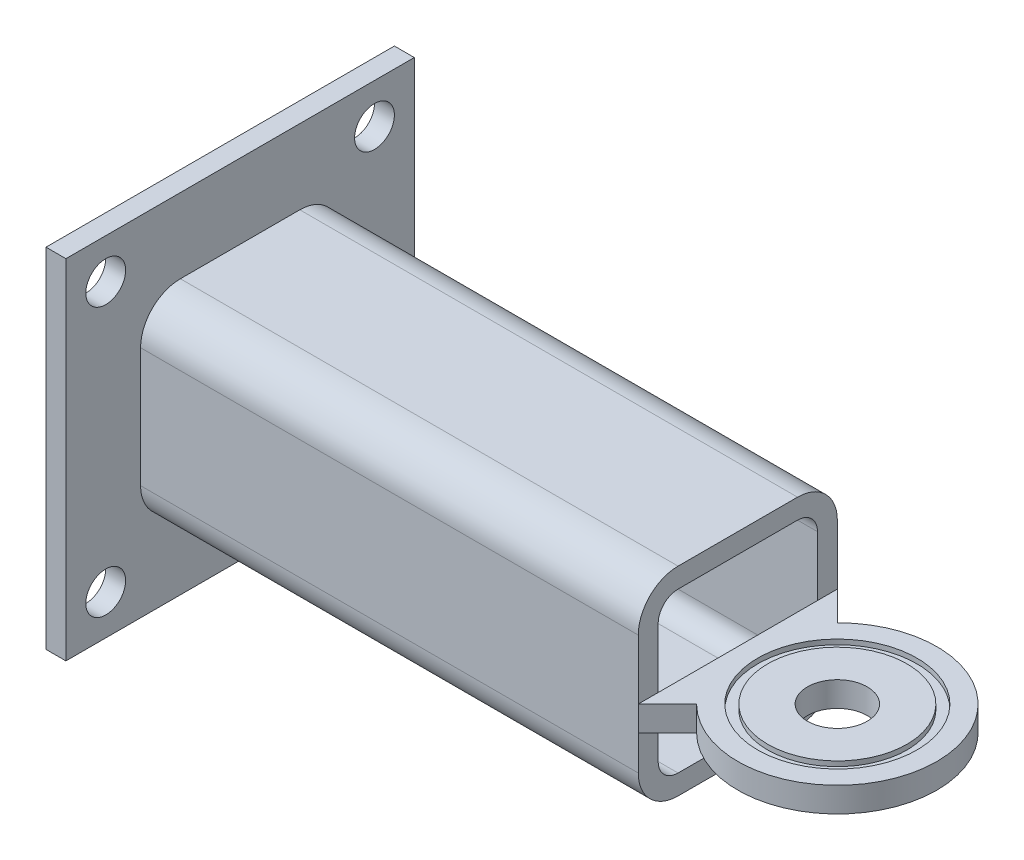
ISO-10303-21;
HEADER;
FILE_DESCRIPTION(('STEP AP214'),'2;1');
FILE_NAME('part.step','',(''),(''),'','','');
FILE_SCHEMA(('AUTOMOTIVE_DESIGN { 1 0 10303 214 1 1 1 1 }'));
ENDSEC;
DATA;
#1=APPLICATION_CONTEXT('core data for automotive mechanical design processes');
#2=APPLICATION_PROTOCOL_DEFINITION('international standard','automotive_design',2000,#1);
#3=PRODUCT_CONTEXT('',#1,'mechanical');
#4=PRODUCT('Part','Part','',(#3));
#5=PRODUCT_RELATED_PRODUCT_CATEGORY('part','',(#4));
#6=PRODUCT_DEFINITION_FORMATION('','',#4);
#7=PRODUCT_DEFINITION_CONTEXT('part definition',#1,'design');
#8=PRODUCT_DEFINITION('design','',#6,#7);
#9=PRODUCT_DEFINITION_SHAPE('','',#8);
#10=(LENGTH_UNIT() NAMED_UNIT(*) SI_UNIT(.MILLI.,.METRE.));
#11=(NAMED_UNIT(*) PLANE_ANGLE_UNIT() SI_UNIT($,.RADIAN.));
#12=(NAMED_UNIT(*) SI_UNIT($,.STERADIAN.) SOLID_ANGLE_UNIT());
#13=UNCERTAINTY_MEASURE_WITH_UNIT(LENGTH_MEASURE(1.E-05),#10,'distance_accuracy_value','');
#14=(GEOMETRIC_REPRESENTATION_CONTEXT(3) GLOBAL_UNCERTAINTY_ASSIGNED_CONTEXT((#13)) GLOBAL_UNIT_ASSIGNED_CONTEXT((#10,
#11,#12)) REPRESENTATION_CONTEXT('',''));
#15=CARTESIAN_POINT('',(0.,0.,0.));
#16=DIRECTION('',(0.,0.,1.));
#17=DIRECTION('',(1.,0.,0.));
#18=AXIS2_PLACEMENT_3D('',#15,#16,#17);
#19=CARTESIAN_POINT('',(42.6756198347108,-2.5,10.));
#20=DIRECTION('',(0.,1.,0.));
#21=DIRECTION('',(0.,0.,1.));
#22=AXIS2_PLACEMENT_3D('',#19,#20,#21);
#23=PLANE('',#22);
#24=CARTESIAN_POINT('',(32.6756198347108,-2.5,0.));
#25=DIRECTION('',(0.,1.,0.));
#26=DIRECTION('',(0.,0.,1.));
#27=AXIS2_PLACEMENT_3D('',#24,#25,#26);
#28=CIRCLE('',#27,3.);
#29=CARTESIAN_POINT('',(32.6756198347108,-2.5,3.));
#30=VERTEX_POINT('',#29);
#31=EDGE_CURVE('E77',#30,#30,#28,.T.);
#32=ORIENTED_EDGE('',*,*,#31,.T.);
#33=EDGE_LOOP('',(#32));
#34=FACE_BOUND('',#33,.T.);
#35=CARTESIAN_POINT('',(32.6756198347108,-2.5,0.));
#36=DIRECTION('',(0.,-1.,0.));
#37=DIRECTION('',(0.,0.,-1.));
#38=AXIS2_PLACEMENT_3D('',#35,#36,#37);
#39=CIRCLE('',#38,7.);
#40=CARTESIAN_POINT('',(32.6756198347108,-2.5,-7.));
#41=VERTEX_POINT('',#40);
#42=EDGE_CURVE('E281',#41,#41,#39,.T.);
#43=ORIENTED_EDGE('',*,*,#42,.T.);
#44=EDGE_LOOP('',(#43));
#45=FACE_BOUND('',#44,.T.);
#46=ADVANCED_FACE('F73',(#34,#45),#23,.F.);
#47=CARTESIAN_POINT('',(42.6756198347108,0.,10.));
#48=DIRECTION('',(0.,-1.,0.));
#49=DIRECTION('',(0.,0.,-1.));
#50=AXIS2_PLACEMENT_3D('',#47,#48,#49);
#51=PLANE('',#50);
#52=CARTESIAN_POINT('',(32.6756198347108,0.,0.));
#53=DIRECTION('',(0.,1.,0.));
#54=DIRECTION('',(0.,0.,1.));
#55=AXIS2_PLACEMENT_3D('',#52,#53,#54);
#56=CIRCLE('',#55,3.);
#57=CARTESIAN_POINT('',(32.6756198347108,0.,3.));
#58=VERTEX_POINT('',#57);
#59=EDGE_CURVE('E316',#58,#58,#56,.T.);
#60=ORIENTED_EDGE('',*,*,#59,.F.);
#61=EDGE_LOOP('',(#60));
#62=FACE_BOUND('',#61,.T.);
#63=CARTESIAN_POINT('',(32.6756198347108,0.,0.));
#64=DIRECTION('',(0.,1.,0.));
#65=DIRECTION('',(0.,0.,1.));
#66=AXIS2_PLACEMENT_3D('',#63,#64,#65);
#67=CIRCLE('',#66,7.);
#68=CARTESIAN_POINT('',(32.6756198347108,0.,7.));
#69=VERTEX_POINT('',#68);
#70=EDGE_CURVE('E300',#69,#69,#67,.T.);
#71=ORIENTED_EDGE('',*,*,#70,.T.);
#72=EDGE_LOOP('',(#71));
#73=FACE_BOUND('',#72,.T.);
#74=ADVANCED_FACE('F670',(#62,#73),#51,.F.);
#75=CARTESIAN_POINT('',(22.6756198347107,-6.,10.));
#76=DIRECTION('',(0.,0.,-1.));
#77=DIRECTION('',(-1.,0.,0.));
#78=AXIS2_PLACEMENT_3D('',#75,#76,#77);
#79=PLANE('',#78);
#80=DIRECTION('',(0.,-1.,0.));
#81=VECTOR('',#80,1.);
#82=CARTESIAN_POINT('',(22.6756198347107,-6.,10.));
#83=LINE('',#82,#81);
#84=CARTESIAN_POINT('',(22.6756198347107,-2.5,10.));
#85=VERTEX_POINT('',#84);
#86=CARTESIAN_POINT('',(22.6756198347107,-6.,10.));
#87=VERTEX_POINT('',#86);
#88=EDGE_CURVE('E412',#85,#87,#83,.T.);
#89=ORIENTED_EDGE('',*,*,#88,.F.);
#90=DIRECTION('',(0.,1.,0.));
#91=VECTOR('',#90,1.);
#92=CARTESIAN_POINT('',(22.6756198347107,-20.,10.));
#93=LINE('',#92,#91);
#94=CARTESIAN_POINT('',(22.6756198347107,0.,10.));
#95=VERTEX_POINT('',#94);
#96=EDGE_CURVE('E328',#85,#95,#93,.T.);
#97=ORIENTED_EDGE('',*,*,#96,.T.);
#98=CARTESIAN_POINT('',(22.6756198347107,6.,10.));
#99=VERTEX_POINT('',#98);
#100=EDGE_CURVE('E413',#99,#95,#83,.T.);
#101=ORIENTED_EDGE('',*,*,#100,.F.);
#102=DIRECTION('',(-1.,0.,0.));
#103=VECTOR('',#102,1.);
#104=CARTESIAN_POINT('',(22.6756198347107,6.,10.));
#105=LINE('',#104,#103);
#106=CARTESIAN_POINT('',(-27.3243801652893,6.,10.));
#107=VERTEX_POINT('',#106);
#108=EDGE_CURVE('E514',#99,#107,#105,.T.);
#109=ORIENTED_EDGE('',*,*,#108,.T.);
#110=DIRECTION('',(0.,-1.,0.));
#111=VECTOR('',#110,1.);
#112=CARTESIAN_POINT('',(-27.3243801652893,-6.,10.));
#113=LINE('',#112,#111);
#114=CARTESIAN_POINT('',(-27.3243801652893,-6.,10.));
#115=VERTEX_POINT('',#114);
#116=EDGE_CURVE('E474',#107,#115,#113,.T.);
#117=ORIENTED_EDGE('',*,*,#116,.T.);
#118=DIRECTION('',(-1.,0.,0.));
#119=VECTOR('',#118,1.);
#120=CARTESIAN_POINT('',(22.6756198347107,-6.,10.));
#121=LINE('',#120,#119);
#122=EDGE_CURVE('E510',#87,#115,#121,.T.);
#123=ORIENTED_EDGE('',*,*,#122,.F.);
#124=EDGE_LOOP('',(#89,#97,#101,#109,#117,#123));
#125=FACE_BOUND('',#124,.T.);
#126=ADVANCED_FACE('F609',(#125),#79,.F.);
#127=CARTESIAN_POINT('',(32.6756198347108,0.,0.));
#128=DIRECTION('',(0.,1.,0.));
#129=DIRECTION('',(0.,0.,1.));
#130=AXIS2_PLACEMENT_3D('',#127,#128,#129);
#131=CIRCLE('',#130,8.);
#132=CARTESIAN_POINT('',(32.6756198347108,0.,8.));
#133=VERTEX_POINT('',#132);
#134=EDGE_CURVE('E308',#133,#133,#131,.T.);
#135=ORIENTED_EDGE('',*,*,#134,.F.);
#136=EDGE_LOOP('',(#135));
#137=FACE_BOUND('',#136,.T.);
#138=DIRECTION('',(-0.707106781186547,0.,0.707106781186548));
#139=VECTOR('',#138,1.);
#140=CARTESIAN_POINT('',(25.6045520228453,0.,7.07106781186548));
#141=LINE('',#140,#139);
#142=CARTESIAN_POINT('',(25.6045520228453,0.,7.07106781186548));
#143=VERTEX_POINT('',#142);
#144=EDGE_CURVE('E323',#143,#95,#141,.T.);
#145=ORIENTED_EDGE('',*,*,#144,.F.);
#146=CARTESIAN_POINT('',(32.6756198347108,0.,0.));
#147=DIRECTION('',(0.,-1.,0.));
#148=DIRECTION('',(0.,0.,-1.));
#149=AXIS2_PLACEMENT_3D('',#146,#147,#148);
#150=CIRCLE('',#149,10.);
#151=CARTESIAN_POINT('',(25.6045520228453,0.,-7.07106781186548));
#152=VERTEX_POINT('',#151);
#153=EDGE_CURVE('E353',#152,#143,#150,.T.);
#154=ORIENTED_EDGE('',*,*,#153,.F.);
#155=DIRECTION('',(0.707106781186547,0.,0.707106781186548));
#156=VECTOR('',#155,1.);
#157=CARTESIAN_POINT('',(25.6045520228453,0.,-7.07106781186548));
#158=LINE('',#157,#156);
#159=CARTESIAN_POINT('',(22.6756198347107,0.,-10.));
#160=VERTEX_POINT('',#159);
#161=EDGE_CURVE('E327',#160,#152,#158,.T.);
#162=ORIENTED_EDGE('',*,*,#161,.F.);
#163=DIRECTION('',(0.,0.,1.));
#164=VECTOR('',#163,1.);
#165=CARTESIAN_POINT('',(22.6756198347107,0.,10.));
#166=LINE('',#165,#164);
#167=CARTESIAN_POINT('',(22.6756198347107,0.,-8.));
#168=VERTEX_POINT('',#167);
#169=EDGE_CURVE('E360',#160,#168,#166,.T.);
#170=ORIENTED_EDGE('',*,*,#169,.T.);
#171=CARTESIAN_POINT('',(22.6756198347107,0.,8.));
#172=VERTEX_POINT('',#171);
#173=EDGE_CURVE('E359',#168,#172,#166,.T.);
#174=ORIENTED_EDGE('',*,*,#173,.T.);
#175=EDGE_CURVE('E83',#172,#95,#166,.T.);
#176=ORIENTED_EDGE('',*,*,#175,.T.);
#177=EDGE_LOOP('',(#145,#154,#162,#170,#174,#176));
#178=FACE_BOUND('',#177,.T.);
#179=ADVANCED_FACE('F638',(#137,#178),#51,.F.);
#180=CARTESIAN_POINT('',(32.6756198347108,-2.5,0.));
#181=DIRECTION('',(0.,-1.,0.));
#182=DIRECTION('',(0.,0.,-1.));
#183=AXIS2_PLACEMENT_3D('',#180,#181,#182);
#184=CIRCLE('',#183,8.);
#185=CARTESIAN_POINT('',(32.6756198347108,-2.5,-8.));
#186=VERTEX_POINT('',#185);
#187=EDGE_CURVE('E294',#186,#186,#184,.T.);
#188=ORIENTED_EDGE('',*,*,#187,.F.);
#189=EDGE_LOOP('',(#188));
#190=FACE_BOUND('',#189,.T.);
#191=CARTESIAN_POINT('',(32.6756198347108,-2.5,0.));
#192=DIRECTION('',(0.,1.,0.));
#193=DIRECTION('',(0.,0.,1.));
#194=AXIS2_PLACEMENT_3D('',#191,#192,#193);
#195=CIRCLE('',#194,10.);
#196=CARTESIAN_POINT('',(25.6045520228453,-2.5,-7.07106781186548));
#197=VERTEX_POINT('',#196);
#198=CARTESIAN_POINT('',(25.6045520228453,-2.5,7.07106781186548));
#199=VERTEX_POINT('',#198);
#200=EDGE_CURVE('E356',#197,#199,#195,.F.);
#201=ORIENTED_EDGE('',*,*,#200,.T.);
#202=DIRECTION('',(-0.707106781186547,0.,0.707106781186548));
#203=VECTOR('',#202,1.);
#204=CARTESIAN_POINT('',(32.6756198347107,-2.5,0.));
#205=LINE('',#204,#203);
#206=EDGE_CURVE('E349',#199,#85,#205,.T.);
#207=ORIENTED_EDGE('',*,*,#206,.T.);
#208=DIRECTION('',(0.,0.,-1.));
#209=VECTOR('',#208,1.);
#210=CARTESIAN_POINT('',(22.6756198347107,-2.5,10.));
#211=LINE('',#210,#209);
#212=CARTESIAN_POINT('',(22.6756198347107,-2.5,8.));
#213=VERTEX_POINT('',#212);
#214=EDGE_CURVE('E85',#85,#213,#211,.T.);
#215=ORIENTED_EDGE('',*,*,#214,.T.);
#216=CARTESIAN_POINT('',(22.6756198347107,-2.5,-8.));
#217=VERTEX_POINT('',#216);
#218=EDGE_CURVE('E86',#213,#217,#211,.T.);
#219=ORIENTED_EDGE('',*,*,#218,.T.);
#220=CARTESIAN_POINT('',(22.6756198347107,-2.5,-10.));
#221=VERTEX_POINT('',#220);
#222=EDGE_CURVE('E12',#217,#221,#211,.T.);
#223=ORIENTED_EDGE('',*,*,#222,.T.);
#224=DIRECTION('',(0.707106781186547,0.,0.707106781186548));
#225=VECTOR('',#224,1.);
#226=CARTESIAN_POINT('',(42.6756198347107,-2.5,10.));
#227=LINE('',#226,#225);
#228=EDGE_CURVE('E332',#221,#197,#227,.T.);
#229=ORIENTED_EDGE('',*,*,#228,.T.);
#230=EDGE_LOOP('',(#201,#207,#215,#219,#223,#229));
#231=FACE_BOUND('',#230,.T.);
#232=ADVANCED_FACE('F617',(#190,#231),#23,.F.);
#233=CARTESIAN_POINT('',(22.6756198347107,6.,-6.));
#234=DIRECTION('',(1.,0.,0.));
#235=DIRECTION('',(0.,0.,-1.));
#236=AXIS2_PLACEMENT_3D('',#233,#234,#235);
#237=PLANE('',#236);
#238=ORIENTED_EDGE('',*,*,#214,.F.);
#239=ORIENTED_EDGE('',*,*,#88,.T.);
#240=CARTESIAN_POINT('',(22.6756198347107,-6.,6.));
#241=DIRECTION('',(1.,0.,0.));
#242=DIRECTION('',(0.,0.,-1.));
#243=AXIS2_PLACEMENT_3D('',#240,#241,#242);
#244=CIRCLE('',#243,4.);
#245=CARTESIAN_POINT('',(22.6756198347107,-10.,6.));
#246=VERTEX_POINT('',#245);
#247=EDGE_CURVE('E416',#87,#246,#244,.T.);
#248=ORIENTED_EDGE('',*,*,#247,.T.);
#249=DIRECTION('',(0.,0.,-1.));
#250=VECTOR('',#249,1.);
#251=CARTESIAN_POINT('',(22.6756198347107,-10.,6.));
#252=LINE('',#251,#250);
#253=CARTESIAN_POINT('',(22.6756198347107,-10.,-6.));
#254=VERTEX_POINT('',#253);
#255=EDGE_CURVE('E419',#246,#254,#252,.T.);
#256=ORIENTED_EDGE('',*,*,#255,.T.);
#257=CARTESIAN_POINT('',(22.6756198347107,-6.,-6.));
#258=DIRECTION('',(1.,0.,0.));
#259=DIRECTION('',(0.,0.,-1.));
#260=AXIS2_PLACEMENT_3D('',#257,#258,#259);
#261=CIRCLE('',#260,4.);
#262=CARTESIAN_POINT('',(22.6756198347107,-6.,-10.));
#263=VERTEX_POINT('',#262);
#264=EDGE_CURVE('E422',#254,#263,#261,.T.);
#265=ORIENTED_EDGE('',*,*,#264,.T.);
#266=DIRECTION('',(0.,1.,0.));
#267=VECTOR('',#266,1.);
#268=CARTESIAN_POINT('',(22.6756198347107,6.,-10.));
#269=LINE('',#268,#267);
#270=EDGE_CURVE('E426',#263,#221,#269,.T.);
#271=ORIENTED_EDGE('',*,*,#270,.T.);
#272=ORIENTED_EDGE('',*,*,#222,.F.);
#273=DIRECTION('',(0.,1.,0.));
#274=VECTOR('',#273,1.);
#275=CARTESIAN_POINT('',(22.6756198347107,6.,-8.));
#276=LINE('',#275,#274);
#277=CARTESIAN_POINT('',(22.6756198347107,-6.,-8.));
#278=VERTEX_POINT('',#277);
#279=EDGE_CURVE('E381',#278,#217,#276,.T.);
#280=ORIENTED_EDGE('',*,*,#279,.F.);
#281=CARTESIAN_POINT('',(22.6756198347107,-6.,-6.));
#282=DIRECTION('',(1.,0.,0.));
#283=DIRECTION('',(0.,0.,-1.));
#284=AXIS2_PLACEMENT_3D('',#281,#282,#283);
#285=CIRCLE('',#284,2.);
#286=CARTESIAN_POINT('',(22.6756198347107,-8.,-6.));
#287=VERTEX_POINT('',#286);
#288=EDGE_CURVE('E385',#287,#278,#285,.T.);
#289=ORIENTED_EDGE('',*,*,#288,.F.);
#290=DIRECTION('',(0.,0.,-1.));
#291=VECTOR('',#290,1.);
#292=CARTESIAN_POINT('',(22.6756198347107,-8.,6.));
#293=LINE('',#292,#291);
#294=CARTESIAN_POINT('',(22.6756198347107,-8.,6.));
#295=VERTEX_POINT('',#294);
#296=EDGE_CURVE('E390',#295,#287,#293,.T.);
#297=ORIENTED_EDGE('',*,*,#296,.F.);
#298=CARTESIAN_POINT('',(22.6756198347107,-6.,6.));
#299=DIRECTION('',(1.,0.,0.));
#300=DIRECTION('',(0.,0.,-1.));
#301=AXIS2_PLACEMENT_3D('',#298,#299,#300);
#302=CIRCLE('',#301,2.);
#303=CARTESIAN_POINT('',(22.6756198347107,-6.,8.));
#304=VERTEX_POINT('',#303);
#305=EDGE_CURVE('E394',#304,#295,#302,.T.);
#306=ORIENTED_EDGE('',*,*,#305,.F.);
#307=DIRECTION('',(0.,-1.,0.));
#308=VECTOR('',#307,1.);
#309=CARTESIAN_POINT('',(22.6756198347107,-6.,8.));
#310=LINE('',#309,#308);
#311=EDGE_CURVE('E93',#213,#304,#310,.T.);
#312=ORIENTED_EDGE('',*,*,#311,.F.);
#313=EDGE_LOOP('',(#238,#239,#248,#256,#265,#271,#272,#280,#289,#297,#306,#312));
#314=FACE_BOUND('',#313,.T.);
#315=ADVANCED_FACE('F619',(#314),#237,.T.);
#316=CARTESIAN_POINT('',(22.6756198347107,6.,-6.));
#317=DIRECTION('',(-1.,0.,0.));
#318=DIRECTION('',(0.,0.,1.));
#319=AXIS2_PLACEMENT_3D('',#316,#317,#318);
#320=CYLINDRICAL_SURFACE('',#319,4.);
#321=CARTESIAN_POINT('',(-27.3243801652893,6.,-6.));
#322=DIRECTION('',(1.,0.,0.));
#323=DIRECTION('',(0.,0.,-1.));
#324=AXIS2_PLACEMENT_3D('',#321,#322,#323);
#325=CIRCLE('',#324,4.);
#326=CARTESIAN_POINT('',(-27.3243801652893,6.,-10.));
#327=VERTEX_POINT('',#326);
#328=CARTESIAN_POINT('',(-27.3243801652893,10.,-6.));
#329=VERTEX_POINT('',#328);
#330=EDGE_CURVE('E462',#327,#329,#325,.T.);
#331=ORIENTED_EDGE('',*,*,#330,.T.);
#332=DIRECTION('',(-1.,0.,0.));
#333=VECTOR('',#332,1.);
#334=CARTESIAN_POINT('',(22.6756198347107,10.,-6.));
#335=LINE('',#334,#333);
#336=CARTESIAN_POINT('',(22.6756198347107,10.,-6.));
#337=VERTEX_POINT('',#336);
#338=EDGE_CURVE('E522',#337,#329,#335,.T.);
#339=ORIENTED_EDGE('',*,*,#338,.F.);
#340=CARTESIAN_POINT('',(22.6756198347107,6.,-6.));
#341=DIRECTION('',(1.,0.,0.));
#342=DIRECTION('',(0.,0.,-1.));
#343=AXIS2_PLACEMENT_3D('',#340,#341,#342);
#344=CIRCLE('',#343,4.);
#345=CARTESIAN_POINT('',(22.6756198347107,6.,-10.));
#346=VERTEX_POINT('',#345);
#347=EDGE_CURVE('E401',#346,#337,#344,.T.);
#348=ORIENTED_EDGE('',*,*,#347,.F.);
#349=DIRECTION('',(-1.,0.,0.));
#350=VECTOR('',#349,1.);
#351=CARTESIAN_POINT('',(22.6756198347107,6.,-10.));
#352=LINE('',#351,#350);
#353=EDGE_CURVE('E493',#346,#327,#352,.T.);
#354=ORIENTED_EDGE('',*,*,#353,.T.);
#355=EDGE_LOOP('',(#331,#339,#348,#354));
#356=FACE_BOUND('',#355,.T.);
#357=ADVANCED_FACE('F598',(#356),#320,.T.);
#358=CARTESIAN_POINT('',(22.6756198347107,10.,-6.));
#359=DIRECTION('',(0.,-1.,0.));
#360=DIRECTION('',(0.,0.,-1.));
#361=AXIS2_PLACEMENT_3D('',#358,#359,#360);
#362=PLANE('',#361);
#363=DIRECTION('',(0.,0.,1.));
#364=VECTOR('',#363,1.);
#365=CARTESIAN_POINT('',(-27.3243801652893,10.,-6.));
#366=LINE('',#365,#364);
#367=CARTESIAN_POINT('',(-27.3243801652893,10.,6.));
#368=VERTEX_POINT('',#367);
#369=EDGE_CURVE('E466',#329,#368,#366,.T.);
#370=ORIENTED_EDGE('',*,*,#369,.T.);
#371=DIRECTION('',(-1.,0.,0.));
#372=VECTOR('',#371,1.);
#373=CARTESIAN_POINT('',(22.6756198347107,10.,6.));
#374=LINE('',#373,#372);
#375=CARTESIAN_POINT('',(22.6756198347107,10.,6.));
#376=VERTEX_POINT('',#375);
#377=EDGE_CURVE('E518',#376,#368,#374,.T.);
#378=ORIENTED_EDGE('',*,*,#377,.F.);
#379=DIRECTION('',(0.,0.,1.));
#380=VECTOR('',#379,1.);
#381=CARTESIAN_POINT('',(22.6756198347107,10.,-6.));
#382=LINE('',#381,#380);
#383=EDGE_CURVE('E406',#337,#376,#382,.T.);
#384=ORIENTED_EDGE('',*,*,#383,.F.);
#385=ORIENTED_EDGE('',*,*,#338,.T.);
#386=EDGE_LOOP('',(#370,#378,#384,#385));
#387=FACE_BOUND('',#386,.T.);
#388=ADVANCED_FACE('F600',(#387),#362,.F.);
#389=CARTESIAN_POINT('',(22.6756198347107,6.,6.));
#390=DIRECTION('',(-1.,0.,0.));
#391=DIRECTION('',(0.,0.,1.));
#392=AXIS2_PLACEMENT_3D('',#389,#390,#391);
#393=CYLINDRICAL_SURFACE('',#392,4.);
#394=CARTESIAN_POINT('',(-27.3243801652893,6.,6.));
#395=DIRECTION('',(1.,0.,0.));
#396=DIRECTION('',(0.,0.,-1.));
#397=AXIS2_PLACEMENT_3D('',#394,#395,#396);
#398=CIRCLE('',#397,4.);
#399=EDGE_CURVE('E470',#368,#107,#398,.T.);
#400=ORIENTED_EDGE('',*,*,#399,.T.);
#401=ORIENTED_EDGE('',*,*,#108,.F.);
#402=CARTESIAN_POINT('',(22.6756198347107,6.,6.));
#403=DIRECTION('',(1.,0.,0.));
#404=DIRECTION('',(0.,0.,-1.));
#405=AXIS2_PLACEMENT_3D('',#402,#403,#404);
#406=CIRCLE('',#405,4.);
#407=EDGE_CURVE('E409',#376,#99,#406,.T.);
#408=ORIENTED_EDGE('',*,*,#407,.F.);
#409=ORIENTED_EDGE('',*,*,#377,.T.);
#410=EDGE_LOOP('',(#400,#401,#408,#409));
#411=FACE_BOUND('',#410,.T.);
#412=ADVANCED_FACE('F606',(#411),#393,.T.);
#413=CARTESIAN_POINT('',(22.6756198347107,-6.,6.));
#414=DIRECTION('',(-1.,0.,0.));
#415=DIRECTION('',(0.,0.,1.));
#416=AXIS2_PLACEMENT_3D('',#413,#414,#415);
#417=CYLINDRICAL_SURFACE('',#416,4.);
#418=CARTESIAN_POINT('',(-27.3243801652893,-6.,6.));
#419=DIRECTION('',(1.,0.,0.));
#420=DIRECTION('',(0.,0.,-1.));
#421=AXIS2_PLACEMENT_3D('',#418,#419,#420);
#422=CIRCLE('',#421,4.);
#423=CARTESIAN_POINT('',(-27.3243801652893,-10.,6.));
#424=VERTEX_POINT('',#423);
#425=EDGE_CURVE('E478',#115,#424,#422,.T.);
#426=ORIENTED_EDGE('',*,*,#425,.T.);
#427=DIRECTION('',(-1.,0.,0.));
#428=VECTOR('',#427,1.);
#429=CARTESIAN_POINT('',(22.6756198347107,-10.,6.));
#430=LINE('',#429,#428);
#431=EDGE_CURVE('E506',#246,#424,#430,.T.);
#432=ORIENTED_EDGE('',*,*,#431,.F.);
#433=ORIENTED_EDGE('',*,*,#247,.F.);
#434=ORIENTED_EDGE('',*,*,#122,.T.);
#435=EDGE_LOOP('',(#426,#432,#433,#434));
#436=FACE_BOUND('',#435,.T.);
#437=ADVANCED_FACE('F623',(#436),#417,.T.);
#438=CARTESIAN_POINT('',(22.6756198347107,-10.,6.));
#439=DIRECTION('',(0.,1.,0.));
#440=DIRECTION('',(0.,0.,1.));
#441=AXIS2_PLACEMENT_3D('',#438,#439,#440);
#442=PLANE('',#441);
#443=DIRECTION('',(0.,0.,-1.));
#444=VECTOR('',#443,1.);
#445=CARTESIAN_POINT('',(-27.3243801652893,-10.,6.));
#446=LINE('',#445,#444);
#447=CARTESIAN_POINT('',(-27.3243801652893,-10.,-6.));
#448=VERTEX_POINT('',#447);
#449=EDGE_CURVE('E482',#424,#448,#446,.T.);
#450=ORIENTED_EDGE('',*,*,#449,.T.);
#451=DIRECTION('',(-1.,0.,0.));
#452=VECTOR('',#451,1.);
#453=CARTESIAN_POINT('',(22.6756198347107,-10.,-6.));
#454=LINE('',#453,#452);
#455=EDGE_CURVE('E502',#254,#448,#454,.T.);
#456=ORIENTED_EDGE('',*,*,#455,.F.);
#457=ORIENTED_EDGE('',*,*,#255,.F.);
#458=ORIENTED_EDGE('',*,*,#431,.T.);
#459=EDGE_LOOP('',(#450,#456,#457,#458));
#460=FACE_BOUND('',#459,.T.);
#461=ADVANCED_FACE('F627',(#460),#442,.F.);
#462=CARTESIAN_POINT('',(22.6756198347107,-6.,-6.));
#463=DIRECTION('',(-1.,0.,0.));
#464=DIRECTION('',(0.,0.,1.));
#465=AXIS2_PLACEMENT_3D('',#462,#463,#464);
#466=CYLINDRICAL_SURFACE('',#465,4.);
#467=CARTESIAN_POINT('',(-27.3243801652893,-6.,-6.));
#468=DIRECTION('',(1.,0.,0.));
#469=DIRECTION('',(0.,0.,-1.));
#470=AXIS2_PLACEMENT_3D('',#467,#468,#469);
#471=CIRCLE('',#470,4.);
#472=CARTESIAN_POINT('',(-27.3243801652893,-6.,-10.));
#473=VERTEX_POINT('',#472);
#474=EDGE_CURVE('E486',#448,#473,#471,.T.);
#475=ORIENTED_EDGE('',*,*,#474,.T.);
#476=DIRECTION('',(-1.,0.,0.));
#477=VECTOR('',#476,1.);
#478=CARTESIAN_POINT('',(22.6756198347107,-6.,-10.));
#479=LINE('',#478,#477);
#480=EDGE_CURVE('E497',#263,#473,#479,.T.);
#481=ORIENTED_EDGE('',*,*,#480,.F.);
#482=ORIENTED_EDGE('',*,*,#264,.F.);
#483=ORIENTED_EDGE('',*,*,#455,.T.);
#484=EDGE_LOOP('',(#475,#481,#482,#483));
#485=FACE_BOUND('',#484,.T.);
#486=ADVANCED_FACE('F632',(#485),#466,.T.);
#487=CARTESIAN_POINT('',(22.6756198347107,6.,6.));
#488=DIRECTION('',(-1.,0.,0.));
#489=DIRECTION('',(0.,0.,1.));
#490=AXIS2_PLACEMENT_3D('',#487,#488,#489);
#491=CYLINDRICAL_SURFACE('',#490,2.);
#492=CARTESIAN_POINT('',(-27.3243801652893,6.,6.));
#493=DIRECTION('',(1.,0.,0.));
#494=DIRECTION('',(0.,0.,-1.));
#495=AXIS2_PLACEMENT_3D('',#492,#493,#494);
#496=CIRCLE('',#495,2.);
#497=CARTESIAN_POINT('',(-27.3243801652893,8.,6.));
#498=VERTEX_POINT('',#497);
#499=CARTESIAN_POINT('',(-27.3243801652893,6.,8.));
#500=VERTEX_POINT('',#499);
#501=EDGE_CURVE('E366',#498,#500,#496,.T.);
#502=ORIENTED_EDGE('',*,*,#501,.F.);
#503=DIRECTION('',(-1.,0.,0.));
#504=VECTOR('',#503,1.);
#505=CARTESIAN_POINT('',(22.6756198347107,8.,6.));
#506=LINE('',#505,#504);
#507=CARTESIAN_POINT('',(22.6756198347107,8.,6.));
#508=VERTEX_POINT('',#507);
#509=EDGE_CURVE('E498',#508,#498,#506,.T.);
#510=ORIENTED_EDGE('',*,*,#509,.F.);
#511=CARTESIAN_POINT('',(22.6756198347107,6.,6.));
#512=DIRECTION('',(1.,0.,0.));
#513=DIRECTION('',(0.,0.,-1.));
#514=AXIS2_PLACEMENT_3D('',#511,#512,#513);
#515=CIRCLE('',#514,2.);
#516=CARTESIAN_POINT('',(22.6756198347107,6.,8.));
#517=VERTEX_POINT('',#516);
#518=EDGE_CURVE('E367',#508,#517,#515,.T.);
#519=ORIENTED_EDGE('',*,*,#518,.T.);
#520=DIRECTION('',(-1.,0.,0.));
#521=VECTOR('',#520,1.);
#522=CARTESIAN_POINT('',(22.6756198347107,6.,8.));
#523=LINE('',#522,#521);
#524=EDGE_CURVE('E430',#517,#500,#523,.T.);
#525=ORIENTED_EDGE('',*,*,#524,.T.);
#526=EDGE_LOOP('',(#502,#510,#519,#525));
#527=FACE_BOUND('',#526,.T.);
#528=ADVANCED_FACE('F75',(#527),#491,.F.);
#529=CARTESIAN_POINT('',(22.6756198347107,8.,-6.));
#530=DIRECTION('',(0.,-1.,0.));
#531=DIRECTION('',(0.,0.,-1.));
#532=AXIS2_PLACEMENT_3D('',#529,#530,#531);
#533=PLANE('',#532);
#534=DIRECTION('',(0.,0.,1.));
#535=VECTOR('',#534,1.);
#536=CARTESIAN_POINT('',(-27.3243801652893,8.,-6.));
#537=LINE('',#536,#535);
#538=CARTESIAN_POINT('',(-27.3243801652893,8.,-6.));
#539=VERTEX_POINT('',#538);
#540=EDGE_CURVE('E434',#539,#498,#537,.T.);
#541=ORIENTED_EDGE('',*,*,#540,.F.);
#542=DIRECTION('',(-1.,0.,0.));
#543=VECTOR('',#542,1.);
#544=CARTESIAN_POINT('',(22.6756198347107,8.,-6.));
#545=LINE('',#544,#543);
#546=CARTESIAN_POINT('',(22.6756198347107,8.,-6.));
#547=VERTEX_POINT('',#546);
#548=EDGE_CURVE('E543',#547,#539,#545,.T.);
#549=ORIENTED_EDGE('',*,*,#548,.F.);
#550=DIRECTION('',(0.,0.,1.));
#551=VECTOR('',#550,1.);
#552=CARTESIAN_POINT('',(22.6756198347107,8.,-6.));
#553=LINE('',#552,#551);
#554=EDGE_CURVE('E371',#547,#508,#553,.T.);
#555=ORIENTED_EDGE('',*,*,#554,.T.);
#556=ORIENTED_EDGE('',*,*,#509,.T.);
#557=EDGE_LOOP('',(#541,#549,#555,#556));
#558=FACE_BOUND('',#557,.T.);
#559=ADVANCED_FACE('F549',(#558),#533,.T.);
#560=CARTESIAN_POINT('',(22.6756198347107,6.,-6.));
#561=DIRECTION('',(-1.,0.,0.));
#562=DIRECTION('',(0.,0.,1.));
#563=AXIS2_PLACEMENT_3D('',#560,#561,#562);
#564=CYLINDRICAL_SURFACE('',#563,2.);
#565=CARTESIAN_POINT('',(-27.3243801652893,6.,-6.));
#566=DIRECTION('',(1.,0.,0.));
#567=DIRECTION('',(0.,0.,-1.));
#568=AXIS2_PLACEMENT_3D('',#565,#566,#567);
#569=CIRCLE('',#568,2.);
#570=CARTESIAN_POINT('',(-27.3243801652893,6.,-8.));
#571=VERTEX_POINT('',#570);
#572=EDGE_CURVE('E438',#571,#539,#569,.T.);
#573=ORIENTED_EDGE('',*,*,#572,.F.);
#574=DIRECTION('',(-1.,0.,0.));
#575=VECTOR('',#574,1.);
#576=CARTESIAN_POINT('',(22.6756198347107,6.,-8.));
#577=LINE('',#576,#575);
#578=CARTESIAN_POINT('',(22.6756198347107,6.,-8.));
#579=VERTEX_POINT('',#578);
#580=EDGE_CURVE('E540',#579,#571,#577,.T.);
#581=ORIENTED_EDGE('',*,*,#580,.F.);
#582=CARTESIAN_POINT('',(22.6756198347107,6.,-6.));
#583=DIRECTION('',(1.,0.,0.));
#584=DIRECTION('',(0.,0.,-1.));
#585=AXIS2_PLACEMENT_3D('',#582,#583,#584);
#586=CIRCLE('',#585,2.);
#587=EDGE_CURVE('E376',#579,#547,#586,.T.);
#588=ORIENTED_EDGE('',*,*,#587,.T.);
#589=ORIENTED_EDGE('',*,*,#548,.T.);
#590=EDGE_LOOP('',(#573,#581,#588,#589));
#591=FACE_BOUND('',#590,.T.);
#592=ADVANCED_FACE('F559',(#591),#564,.F.);
#593=CARTESIAN_POINT('',(22.6756198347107,6.,-8.));
#594=DIRECTION('',(0.,0.,1.));
#595=DIRECTION('',(1.,0.,0.));
#596=AXIS2_PLACEMENT_3D('',#593,#594,#595);
#597=PLANE('',#596);
#598=DIRECTION('',(0.,1.,0.));
#599=VECTOR('',#598,1.);
#600=CARTESIAN_POINT('',(-27.3243801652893,6.,-8.));
#601=LINE('',#600,#599);
#602=CARTESIAN_POINT('',(-27.3243801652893,-6.,-8.));
#603=VERTEX_POINT('',#602);
#604=EDGE_CURVE('E442',#603,#571,#601,.T.);
#605=ORIENTED_EDGE('',*,*,#604,.F.);
#606=DIRECTION('',(-1.,0.,0.));
#607=VECTOR('',#606,1.);
#608=CARTESIAN_POINT('',(22.6756198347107,-6.,-8.));
#609=LINE('',#608,#607);
#610=EDGE_CURVE('E537',#278,#603,#609,.T.);
#611=ORIENTED_EDGE('',*,*,#610,.F.);
#612=ORIENTED_EDGE('',*,*,#279,.T.);
#613=EDGE_CURVE('E386',#217,#168,#276,.T.);
#614=ORIENTED_EDGE('',*,*,#613,.T.);
#615=EDGE_CURVE('E380',#168,#579,#276,.T.);
#616=ORIENTED_EDGE('',*,*,#615,.T.);
#617=ORIENTED_EDGE('',*,*,#580,.T.);
#618=EDGE_LOOP('',(#605,#611,#612,#614,#616,#617));
#619=FACE_BOUND('',#618,.T.);
#620=ADVANCED_FACE('F581',(#619),#597,.T.);
#621=CARTESIAN_POINT('',(22.6756198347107,-6.,-6.));
#622=DIRECTION('',(-1.,0.,0.));
#623=DIRECTION('',(0.,0.,1.));
#624=AXIS2_PLACEMENT_3D('',#621,#622,#623);
#625=CYLINDRICAL_SURFACE('',#624,2.);
#626=CARTESIAN_POINT('',(-27.3243801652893,-6.,-6.));
#627=DIRECTION('',(1.,0.,0.));
#628=DIRECTION('',(0.,0.,-1.));
#629=AXIS2_PLACEMENT_3D('',#626,#627,#628);
#630=CIRCLE('',#629,2.);
#631=CARTESIAN_POINT('',(-27.3243801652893,-8.,-6.));
#632=VERTEX_POINT('',#631);
#633=EDGE_CURVE('E446',#632,#603,#630,.T.);
#634=ORIENTED_EDGE('',*,*,#633,.F.);
#635=DIRECTION('',(-1.,0.,0.));
#636=VECTOR('',#635,1.);
#637=CARTESIAN_POINT('',(22.6756198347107,-8.,-6.));
#638=LINE('',#637,#636);
#639=EDGE_CURVE('E534',#287,#632,#638,.T.);
#640=ORIENTED_EDGE('',*,*,#639,.F.);
#641=ORIENTED_EDGE('',*,*,#288,.T.);
#642=ORIENTED_EDGE('',*,*,#610,.T.);
#643=EDGE_LOOP('',(#634,#640,#641,#642));
#644=FACE_BOUND('',#643,.T.);
#645=ADVANCED_FACE('F578',(#644),#625,.F.);
#646=CARTESIAN_POINT('',(22.6756198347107,-8.,6.));
#647=DIRECTION('',(0.,1.,0.));
#648=DIRECTION('',(0.,0.,1.));
#649=AXIS2_PLACEMENT_3D('',#646,#647,#648);
#650=PLANE('',#649);
#651=DIRECTION('',(0.,0.,-1.));
#652=VECTOR('',#651,1.);
#653=CARTESIAN_POINT('',(-27.3243801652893,-8.,6.));
#654=LINE('',#653,#652);
#655=CARTESIAN_POINT('',(-27.3243801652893,-8.,6.));
#656=VERTEX_POINT('',#655);
#657=EDGE_CURVE('E450',#656,#632,#654,.T.);
#658=ORIENTED_EDGE('',*,*,#657,.F.);
#659=DIRECTION('',(-1.,0.,0.));
#660=VECTOR('',#659,1.);
#661=CARTESIAN_POINT('',(22.6756198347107,-8.,6.));
#662=LINE('',#661,#660);
#663=EDGE_CURVE('E531',#295,#656,#662,.T.);
#664=ORIENTED_EDGE('',*,*,#663,.F.);
#665=ORIENTED_EDGE('',*,*,#296,.T.);
#666=ORIENTED_EDGE('',*,*,#639,.T.);
#667=EDGE_LOOP('',(#658,#664,#665,#666));
#668=FACE_BOUND('',#667,.T.);
#669=ADVANCED_FACE('F574',(#668),#650,.T.);
#670=CARTESIAN_POINT('',(22.6756198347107,-6.,6.));
#671=DIRECTION('',(-1.,0.,0.));
#672=DIRECTION('',(0.,0.,1.));
#673=AXIS2_PLACEMENT_3D('',#670,#671,#672);
#674=CYLINDRICAL_SURFACE('',#673,2.);
#675=CARTESIAN_POINT('',(-27.3243801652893,-6.,6.));
#676=DIRECTION('',(1.,0.,0.));
#677=DIRECTION('',(0.,0.,-1.));
#678=AXIS2_PLACEMENT_3D('',#675,#676,#677);
#679=CIRCLE('',#678,2.);
#680=CARTESIAN_POINT('',(-27.3243801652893,-6.,8.));
#681=VERTEX_POINT('',#680);
#682=EDGE_CURVE('E454',#681,#656,#679,.T.);
#683=ORIENTED_EDGE('',*,*,#682,.F.);
#684=DIRECTION('',(-1.,0.,0.));
#685=VECTOR('',#684,1.);
#686=CARTESIAN_POINT('',(22.6756198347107,-6.,8.));
#687=LINE('',#686,#685);
#688=EDGE_CURVE('E528',#304,#681,#687,.T.);
#689=ORIENTED_EDGE('',*,*,#688,.F.);
#690=ORIENTED_EDGE('',*,*,#305,.T.);
#691=ORIENTED_EDGE('',*,*,#663,.T.);
#692=EDGE_LOOP('',(#683,#689,#690,#691));
#693=FACE_BOUND('',#692,.T.);
#694=ADVANCED_FACE('F571',(#693),#674,.F.);
#695=CARTESIAN_POINT('',(22.6756198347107,-6.,8.));
#696=DIRECTION('',(0.,0.,-1.));
#697=DIRECTION('',(-1.,0.,0.));
#698=AXIS2_PLACEMENT_3D('',#695,#696,#697);
#699=PLANE('',#698);
#700=DIRECTION('',(0.,-1.,0.));
#701=VECTOR('',#700,1.);
#702=CARTESIAN_POINT('',(-27.3243801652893,-6.,8.));
#703=LINE('',#702,#701);
#704=EDGE_CURVE('E458',#500,#681,#703,.T.);
#705=ORIENTED_EDGE('',*,*,#704,.F.);
#706=ORIENTED_EDGE('',*,*,#524,.F.);
#707=EDGE_CURVE('E398',#517,#172,#310,.T.);
#708=ORIENTED_EDGE('',*,*,#707,.T.);
#709=EDGE_CURVE('E402',#172,#213,#310,.T.);
#710=ORIENTED_EDGE('',*,*,#709,.T.);
#711=ORIENTED_EDGE('',*,*,#311,.T.);
#712=ORIENTED_EDGE('',*,*,#688,.T.);
#713=EDGE_LOOP('',(#705,#706,#708,#710,#711,#712));
#714=FACE_BOUND('',#713,.T.);
#715=ADVANCED_FACE('F566',(#714),#699,.T.);
#716=CARTESIAN_POINT('',(22.6756198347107,6.,-10.));
#717=DIRECTION('',(0.,0.,1.));
#718=DIRECTION('',(1.,0.,0.));
#719=AXIS2_PLACEMENT_3D('',#716,#717,#718);
#720=PLANE('',#719);
#721=EDGE_CURVE('E425',#160,#346,#269,.T.);
#722=ORIENTED_EDGE('',*,*,#721,.F.);
#723=DIRECTION('',(0.,1.,0.));
#724=VECTOR('',#723,1.);
#725=CARTESIAN_POINT('',(22.6756198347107,-20.,-10.));
#726=LINE('',#725,#724);
#727=EDGE_CURVE('E336',#221,#160,#726,.T.);
#728=ORIENTED_EDGE('',*,*,#727,.F.);
#729=ORIENTED_EDGE('',*,*,#270,.F.);
#730=ORIENTED_EDGE('',*,*,#480,.T.);
#731=DIRECTION('',(0.,1.,0.));
#732=VECTOR('',#731,1.);
#733=CARTESIAN_POINT('',(-27.3243801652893,6.,-10.));
#734=LINE('',#733,#732);
#735=EDGE_CURVE('E372',#473,#327,#734,.T.);
#736=ORIENTED_EDGE('',*,*,#735,.T.);
#737=ORIENTED_EDGE('',*,*,#353,.F.);
#738=EDGE_LOOP('',(#722,#728,#729,#730,#736,#737));
#739=FACE_BOUND('',#738,.T.);
#740=ADVANCED_FACE('F596',(#739),#720,.F.);
#741=ORIENTED_EDGE('',*,*,#169,.F.);
#742=ORIENTED_EDGE('',*,*,#721,.T.);
#743=ORIENTED_EDGE('',*,*,#347,.T.);
#744=ORIENTED_EDGE('',*,*,#383,.T.);
#745=ORIENTED_EDGE('',*,*,#407,.T.);
#746=ORIENTED_EDGE('',*,*,#100,.T.);
#747=ORIENTED_EDGE('',*,*,#175,.F.);
#748=ORIENTED_EDGE('',*,*,#707,.F.);
#749=ORIENTED_EDGE('',*,*,#518,.F.);
#750=ORIENTED_EDGE('',*,*,#554,.F.);
#751=ORIENTED_EDGE('',*,*,#587,.F.);
#752=ORIENTED_EDGE('',*,*,#615,.F.);
#753=EDGE_LOOP('',(#741,#742,#743,#744,#745,#746,#747,#748,#749,#750,#751,#752));
#754=FACE_BOUND('',#753,.T.);
#755=ADVANCED_FACE('F562',(#754),#237,.T.);
#756=CARTESIAN_POINT('',(22.6756198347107,0.,0.));
#757=DIRECTION('',(1.,0.,0.));
#758=DIRECTION('',(0.,0.,-1.));
#759=AXIS2_PLACEMENT_3D('',#756,#757,#758);
#760=PLANE('',#759);
#761=ORIENTED_EDGE('',*,*,#613,.F.);
#762=ORIENTED_EDGE('',*,*,#218,.F.);
#763=ORIENTED_EDGE('',*,*,#709,.F.);
#764=ORIENTED_EDGE('',*,*,#173,.F.);
#765=EDGE_LOOP('',(#761,#762,#763,#764));
#766=FACE_BOUND('',#765,.T.);
#767=ADVANCED_FACE('F644',(#766),#760,.F.);
#768=CARTESIAN_POINT('',(32.6756198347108,-20.,0.));
#769=DIRECTION('',(0.,1.,0.));
#770=DIRECTION('',(0.,0.,1.));
#771=AXIS2_PLACEMENT_3D('',#768,#769,#770);
#772=CYLINDRICAL_SURFACE('',#771,10.);
#773=ORIENTED_EDGE('',*,*,#200,.F.);
#774=DIRECTION('',(0.,1.,0.));
#775=VECTOR('',#774,1.);
#776=CARTESIAN_POINT('',(25.6045520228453,-20.,-7.07106781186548));
#777=LINE('',#776,#775);
#778=EDGE_CURVE('E339',#197,#152,#777,.T.);
#779=ORIENTED_EDGE('',*,*,#778,.T.);
#780=ORIENTED_EDGE('',*,*,#153,.T.);
#781=DIRECTION('',(0.,1.,0.));
#782=VECTOR('',#781,1.);
#783=CARTESIAN_POINT('',(25.6045520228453,-20.,7.07106781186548));
#784=LINE('',#783,#782);
#785=EDGE_CURVE('E326',#199,#143,#784,.T.);
#786=ORIENTED_EDGE('',*,*,#785,.F.);
#787=EDGE_LOOP('',(#773,#779,#780,#786));
#788=FACE_BOUND('',#787,.T.);
#789=ADVANCED_FACE('F641',(#788),#772,.T.);
#790=CARTESIAN_POINT('',(25.6045520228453,-20.,-7.07106781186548));
#791=DIRECTION('',(-0.707106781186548,0.,0.707106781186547));
#792=DIRECTION('',(0.707106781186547,0.,0.707106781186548));
#793=AXIS2_PLACEMENT_3D('',#790,#791,#792);
#794=PLANE('',#793);
#795=ORIENTED_EDGE('',*,*,#727,.T.);
#796=ORIENTED_EDGE('',*,*,#161,.T.);
#797=ORIENTED_EDGE('',*,*,#778,.F.);
#798=ORIENTED_EDGE('',*,*,#228,.F.);
#799=EDGE_LOOP('',(#795,#796,#797,#798));
#800=FACE_BOUND('',#799,.T.);
#801=ADVANCED_FACE('F635',(#800),#794,.F.);
#802=CARTESIAN_POINT('',(25.6045520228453,-20.,7.07106781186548));
#803=DIRECTION('',(-0.707106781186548,0.,-0.707106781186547));
#804=DIRECTION('',(-0.707106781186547,0.,0.707106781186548));
#805=AXIS2_PLACEMENT_3D('',#802,#803,#804);
#806=PLANE('',#805);
#807=ORIENTED_EDGE('',*,*,#785,.T.);
#808=ORIENTED_EDGE('',*,*,#144,.T.);
#809=ORIENTED_EDGE('',*,*,#96,.F.);
#810=ORIENTED_EDGE('',*,*,#206,.F.);
#811=EDGE_LOOP('',(#807,#808,#809,#810));
#812=FACE_BOUND('',#811,.T.);
#813=ADVANCED_FACE('F613',(#812),#806,.F.);
#814=CARTESIAN_POINT('',(32.6756198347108,-20.,0.));
#815=DIRECTION('',(0.,1.,0.));
#816=DIRECTION('',(0.,0.,1.));
#817=AXIS2_PLACEMENT_3D('',#814,#815,#816);
#818=CYLINDRICAL_SURFACE('',#817,3.);
#819=ORIENTED_EDGE('',*,*,#59,.T.);
#820=EDGE_LOOP('',(#819));
#821=FACE_BOUND('',#820,.T.);
#822=ORIENTED_EDGE('',*,*,#31,.F.);
#823=EDGE_LOOP('',(#822));
#824=FACE_BOUND('',#823,.T.);
#825=ADVANCED_FACE('F655',(#821,#824),#818,.F.);
#826=CARTESIAN_POINT('',(32.6756198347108,-0.5,0.));
#827=DIRECTION('',(0.,1.,0.));
#828=DIRECTION('',(0.,0.,1.));
#829=AXIS2_PLACEMENT_3D('',#826,#827,#828);
#830=CYLINDRICAL_SURFACE('',#829,8.);
#831=CARTESIAN_POINT('',(32.6756198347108,-0.5,0.));
#832=DIRECTION('',(0.,1.,0.));
#833=DIRECTION('',(0.,0.,1.));
#834=AXIS2_PLACEMENT_3D('',#831,#832,#833);
#835=CIRCLE('',#834,8.);
#836=CARTESIAN_POINT('',(32.6756198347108,-0.5,8.));
#837=VERTEX_POINT('',#836);
#838=EDGE_CURVE('E312',#837,#837,#835,.T.);
#839=ORIENTED_EDGE('',*,*,#838,.F.);
#840=EDGE_LOOP('',(#839));
#841=FACE_BOUND('',#840,.T.);
#842=ORIENTED_EDGE('',*,*,#134,.T.);
#843=EDGE_LOOP('',(#842));
#844=FACE_BOUND('',#843,.T.);
#845=ADVANCED_FACE('F657',(#841,#844),#830,.F.);
#846=CARTESIAN_POINT('',(32.6756198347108,-0.5,0.));
#847=DIRECTION('',(0.,1.,0.));
#848=DIRECTION('',(0.,0.,1.));
#849=AXIS2_PLACEMENT_3D('',#846,#847,#848);
#850=PLANE('',#849);
#851=CARTESIAN_POINT('',(32.6756198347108,-0.5,0.));
#852=DIRECTION('',(0.,1.,0.));
#853=DIRECTION('',(0.,0.,1.));
#854=AXIS2_PLACEMENT_3D('',#851,#852,#853);
#855=CIRCLE('',#854,7.);
#856=CARTESIAN_POINT('',(32.6756198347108,-0.5,7.));
#857=VERTEX_POINT('',#856);
#858=EDGE_CURVE('E304',#857,#857,#855,.T.);
#859=ORIENTED_EDGE('',*,*,#858,.F.);
#860=EDGE_LOOP('',(#859));
#861=FACE_BOUND('',#860,.T.);
#862=ORIENTED_EDGE('',*,*,#838,.T.);
#863=EDGE_LOOP('',(#862));
#864=FACE_BOUND('',#863,.T.);
#865=ADVANCED_FACE('F665',(#861,#864),#850,.T.);
#866=CARTESIAN_POINT('',(32.6756198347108,-0.5,0.));
#867=DIRECTION('',(0.,1.,0.));
#868=DIRECTION('',(0.,0.,1.));
#869=AXIS2_PLACEMENT_3D('',#866,#867,#868);
#870=CYLINDRICAL_SURFACE('',#869,7.);
#871=ORIENTED_EDGE('',*,*,#858,.T.);
#872=EDGE_LOOP('',(#871));
#873=FACE_BOUND('',#872,.T.);
#874=ORIENTED_EDGE('',*,*,#70,.F.);
#875=EDGE_LOOP('',(#874));
#876=FACE_BOUND('',#875,.T.);
#877=ADVANCED_FACE('F691',(#873,#876),#870,.T.);
#878=CARTESIAN_POINT('',(32.6756198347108,-2.3,0.));
#879=DIRECTION('',(0.,-1.,0.));
#880=DIRECTION('',(0.,0.,-1.));
#881=AXIS2_PLACEMENT_3D('',#878,#879,#880);
#882=CYLINDRICAL_SURFACE('',#881,8.);
#883=CARTESIAN_POINT('',(32.6756198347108,-2.3,0.));
#884=DIRECTION('',(0.,-1.,0.));
#885=DIRECTION('',(0.,0.,-1.));
#886=AXIS2_PLACEMENT_3D('',#883,#884,#885);
#887=CIRCLE('',#886,8.);
#888=CARTESIAN_POINT('',(32.6756198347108,-2.3,-8.));
#889=VERTEX_POINT('',#888);
#890=EDGE_CURVE('E296',#889,#889,#887,.T.);
#891=ORIENTED_EDGE('',*,*,#890,.F.);
#892=EDGE_LOOP('',(#891));
#893=FACE_BOUND('',#892,.T.);
#894=ORIENTED_EDGE('',*,*,#187,.T.);
#895=EDGE_LOOP('',(#894));
#896=FACE_BOUND('',#895,.T.);
#897=ADVANCED_FACE('F689',(#893,#896),#882,.F.);
#898=CARTESIAN_POINT('',(32.6756198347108,-2.3,0.));
#899=DIRECTION('',(0.,-1.,0.));
#900=DIRECTION('',(0.,0.,-1.));
#901=AXIS2_PLACEMENT_3D('',#898,#899,#900);
#902=PLANE('',#901);
#903=CARTESIAN_POINT('',(32.6756198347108,-2.3,0.));
#904=DIRECTION('',(0.,-1.,0.));
#905=DIRECTION('',(0.,0.,-1.));
#906=AXIS2_PLACEMENT_3D('',#903,#904,#905);
#907=CIRCLE('',#906,7.);
#908=CARTESIAN_POINT('',(32.6756198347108,-2.3,-7.));
#909=VERTEX_POINT('',#908);
#910=EDGE_CURVE('E286',#909,#909,#907,.T.);
#911=ORIENTED_EDGE('',*,*,#910,.F.);
#912=EDGE_LOOP('',(#911));
#913=FACE_BOUND('',#912,.T.);
#914=ORIENTED_EDGE('',*,*,#890,.T.);
#915=EDGE_LOOP('',(#914));
#916=FACE_BOUND('',#915,.T.);
#917=ADVANCED_FACE('F690',(#913,#916),#902,.T.);
#918=CARTESIAN_POINT('',(32.6756198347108,-2.3,0.));
#919=DIRECTION('',(0.,-1.,0.));
#920=DIRECTION('',(0.,0.,-1.));
#921=AXIS2_PLACEMENT_3D('',#918,#919,#920);
#922=CYLINDRICAL_SURFACE('',#921,7.);
#923=ORIENTED_EDGE('',*,*,#910,.T.);
#924=EDGE_LOOP('',(#923));
#925=FACE_BOUND('',#924,.T.);
#926=ORIENTED_EDGE('',*,*,#42,.F.);
#927=EDGE_LOOP('',(#926));
#928=FACE_BOUND('',#927,.T.);
#929=ADVANCED_FACE('F697',(#925,#928),#922,.T.);
#930=CARTESIAN_POINT('',(-27.3243801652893,0.,0.));
#931=DIRECTION('',(-1.,0.,0.));
#932=DIRECTION('',(0.,0.,1.));
#933=AXIS2_PLACEMENT_3D('',#930,#931,#932);
#934=PLANE('',#933);
#935=CARTESIAN_POINT('',(-27.3243801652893,13.5,-13.5));
#936=DIRECTION('',(1.,0.,0.));
#937=DIRECTION('',(0.,0.,-1.));
#938=AXIS2_PLACEMENT_3D('',#935,#936,#937);
#939=CIRCLE('',#938,2.);
#940=CARTESIAN_POINT('',(-27.3243801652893,13.5,-15.5));
#941=VERTEX_POINT('',#940);
#942=EDGE_CURVE('E860',#941,#941,#939,.T.);
#943=ORIENTED_EDGE('',*,*,#942,.F.);
#944=EDGE_LOOP('',(#943));
#945=FACE_BOUND('',#944,.T.);
#946=CARTESIAN_POINT('',(-27.3243801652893,-13.5,-13.5));
#947=DIRECTION('',(1.,0.,0.));
#948=DIRECTION('',(0.,0.,-1.));
#949=AXIS2_PLACEMENT_3D('',#946,#947,#948);
#950=CIRCLE('',#949,2.);
#951=CARTESIAN_POINT('',(-27.3243801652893,-13.5,-15.5));
#952=VERTEX_POINT('',#951);
#953=EDGE_CURVE('E867',#952,#952,#950,.T.);
#954=ORIENTED_EDGE('',*,*,#953,.F.);
#955=EDGE_LOOP('',(#954));
#956=FACE_BOUND('',#955,.T.);
#957=CARTESIAN_POINT('',(-27.3243801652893,-13.5,13.5));
#958=DIRECTION('',(1.,0.,0.));
#959=DIRECTION('',(0.,0.,-1.));
#960=AXIS2_PLACEMENT_3D('',#957,#958,#959);
#961=CIRCLE('',#960,2.);
#962=CARTESIAN_POINT('',(-27.3243801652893,-13.5,11.5));
#963=VERTEX_POINT('',#962);
#964=EDGE_CURVE('E879',#963,#963,#961,.T.);
#965=ORIENTED_EDGE('',*,*,#964,.F.);
#966=EDGE_LOOP('',(#965));
#967=FACE_BOUND('',#966,.T.);
#968=CARTESIAN_POINT('',(-27.3243801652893,13.5,13.5));
#969=DIRECTION('',(1.,0.,0.));
#970=DIRECTION('',(0.,0.,-1.));
#971=AXIS2_PLACEMENT_3D('',#968,#969,#970);
#972=CIRCLE('',#971,2.);
#973=CARTESIAN_POINT('',(-27.3243801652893,13.5,11.5));
#974=VERTEX_POINT('',#973);
#975=EDGE_CURVE('E876',#974,#974,#972,.T.);
#976=ORIENTED_EDGE('',*,*,#975,.F.);
#977=EDGE_LOOP('',(#976));
#978=FACE_BOUND('',#977,.T.);
#979=ORIENTED_EDGE('',*,*,#330,.F.);
#980=ORIENTED_EDGE('',*,*,#735,.F.);
#981=ORIENTED_EDGE('',*,*,#474,.F.);
#982=ORIENTED_EDGE('',*,*,#449,.F.);
#983=ORIENTED_EDGE('',*,*,#425,.F.);
#984=ORIENTED_EDGE('',*,*,#116,.F.);
#985=ORIENTED_EDGE('',*,*,#399,.F.);
#986=ORIENTED_EDGE('',*,*,#369,.F.);
#987=EDGE_LOOP('',(#979,#980,#981,#982,#983,#984,#985,#986));
#988=FACE_BOUND('',#987,.T.);
#989=DIRECTION('',(0.,1.,0.));
#990=VECTOR('',#989,1.);
#991=CARTESIAN_POINT('',(-27.3243801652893,17.5,17.5));
#992=LINE('',#991,#990);
#993=CARTESIAN_POINT('',(-27.3243801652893,-17.5,17.5));
#994=VERTEX_POINT('',#993);
#995=CARTESIAN_POINT('',(-27.3243801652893,17.5,17.5));
#996=VERTEX_POINT('',#995);
#997=EDGE_CURVE('E279',#994,#996,#992,.T.);
#998=ORIENTED_EDGE('',*,*,#997,.F.);
#999=DIRECTION('',(0.,0.,1.));
#1000=VECTOR('',#999,1.);
#1001=CARTESIAN_POINT('',(-27.3243801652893,-17.5,-17.5));
#1002=LINE('',#1001,#1000);
#1003=CARTESIAN_POINT('',(-27.3243801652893,-17.5,-17.5));
#1004=VERTEX_POINT('',#1003);
#1005=EDGE_CURVE('E275',#1004,#994,#1002,.T.);
#1006=ORIENTED_EDGE('',*,*,#1005,.F.);
#1007=DIRECTION('',(0.,-1.,0.));
#1008=VECTOR('',#1007,1.);
#1009=CARTESIAN_POINT('',(-27.3243801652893,17.5,-17.5));
#1010=LINE('',#1009,#1008);
#1011=CARTESIAN_POINT('',(-27.3243801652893,17.5,-17.5));
#1012=VERTEX_POINT('',#1011);
#1013=EDGE_CURVE('E891',#1012,#1004,#1010,.T.);
#1014=ORIENTED_EDGE('',*,*,#1013,.F.);
#1015=DIRECTION('',(0.,0.,-1.));
#1016=VECTOR('',#1015,1.);
#1017=CARTESIAN_POINT('',(-27.3243801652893,17.5,-17.5));
#1018=LINE('',#1017,#1016);
#1019=EDGE_CURVE('E888',#996,#1012,#1018,.T.);
#1020=ORIENTED_EDGE('',*,*,#1019,.F.);
#1021=EDGE_LOOP('',(#998,#1006,#1014,#1020));
#1022=FACE_BOUND('',#1021,.T.);
#1023=ADVANCED_FACE('F748',(#945,#956,#967,#978,#988,#1022),#934,.F.);
#1024=CARTESIAN_POINT('',(-29.3243801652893,0.,0.));
#1025=DIRECTION('',(-1.,0.,0.));
#1026=DIRECTION('',(0.,0.,1.));
#1027=AXIS2_PLACEMENT_3D('',#1024,#1025,#1026);
#1028=PLANE('',#1027);
#1029=CARTESIAN_POINT('',(-29.3243801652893,13.5,-13.5));
#1030=DIRECTION('',(1.,0.,0.));
#1031=DIRECTION('',(0.,0.,-1.));
#1032=AXIS2_PLACEMENT_3D('',#1029,#1030,#1031);
#1033=CIRCLE('',#1032,2.);
#1034=CARTESIAN_POINT('',(-29.3243801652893,13.5,-15.5));
#1035=VERTEX_POINT('',#1034);
#1036=EDGE_CURVE('E857',#1035,#1035,#1033,.T.);
#1037=ORIENTED_EDGE('',*,*,#1036,.T.);
#1038=EDGE_LOOP('',(#1037));
#1039=FACE_BOUND('',#1038,.T.);
#1040=CARTESIAN_POINT('',(-29.3243801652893,-13.5,-13.5));
#1041=DIRECTION('',(1.,0.,0.));
#1042=DIRECTION('',(0.,0.,-1.));
#1043=AXIS2_PLACEMENT_3D('',#1040,#1041,#1042);
#1044=CIRCLE('',#1043,2.);
#1045=CARTESIAN_POINT('',(-29.3243801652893,-13.5,-15.5));
#1046=VERTEX_POINT('',#1045);
#1047=EDGE_CURVE('E862',#1046,#1046,#1044,.T.);
#1048=ORIENTED_EDGE('',*,*,#1047,.T.);
#1049=EDGE_LOOP('',(#1048));
#1050=FACE_BOUND('',#1049,.T.);
#1051=CARTESIAN_POINT('',(-29.3243801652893,-13.5,13.5));
#1052=DIRECTION('',(1.,0.,0.));
#1053=DIRECTION('',(0.,0.,-1.));
#1054=AXIS2_PLACEMENT_3D('',#1051,#1052,#1053);
#1055=CIRCLE('',#1054,2.);
#1056=CARTESIAN_POINT('',(-29.3243801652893,-13.5,11.5));
#1057=VERTEX_POINT('',#1056);
#1058=EDGE_CURVE('E906',#1057,#1057,#1055,.T.);
#1059=ORIENTED_EDGE('',*,*,#1058,.T.);
#1060=EDGE_LOOP('',(#1059));
#1061=FACE_BOUND('',#1060,.T.);
#1062=CARTESIAN_POINT('',(-29.3243801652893,13.5,13.5));
#1063=DIRECTION('',(1.,0.,0.));
#1064=DIRECTION('',(0.,0.,-1.));
#1065=AXIS2_PLACEMENT_3D('',#1062,#1063,#1064);
#1066=CIRCLE('',#1065,2.);
#1067=CARTESIAN_POINT('',(-29.3243801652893,13.5,11.5));
#1068=VERTEX_POINT('',#1067);
#1069=EDGE_CURVE('E872',#1068,#1068,#1066,.T.);
#1070=ORIENTED_EDGE('',*,*,#1069,.T.);
#1071=EDGE_LOOP('',(#1070));
#1072=FACE_BOUND('',#1071,.T.);
#1073=DIRECTION('',(0.,1.,0.));
#1074=VECTOR('',#1073,1.);
#1075=CARTESIAN_POINT('',(-29.3243801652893,17.5,17.5));
#1076=LINE('',#1075,#1074);
#1077=CARTESIAN_POINT('',(-29.3243801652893,-17.5,17.5));
#1078=VERTEX_POINT('',#1077);
#1079=CARTESIAN_POINT('',(-29.3243801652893,17.5,17.5));
#1080=VERTEX_POINT('',#1079);
#1081=EDGE_CURVE('E265',#1078,#1080,#1076,.T.);
#1082=ORIENTED_EDGE('',*,*,#1081,.T.);
#1083=DIRECTION('',(0.,0.,-1.));
#1084=VECTOR('',#1083,1.);
#1085=CARTESIAN_POINT('',(-29.3243801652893,17.5,-17.5));
#1086=LINE('',#1085,#1084);
#1087=CARTESIAN_POINT('',(-29.3243801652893,17.5,-17.5));
#1088=VERTEX_POINT('',#1087);
#1089=EDGE_CURVE('E253',#1080,#1088,#1086,.T.);
#1090=ORIENTED_EDGE('',*,*,#1089,.T.);
#1091=DIRECTION('',(0.,-1.,0.));
#1092=VECTOR('',#1091,1.);
#1093=CARTESIAN_POINT('',(-29.3243801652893,17.5,-17.5));
#1094=LINE('',#1093,#1092);
#1095=CARTESIAN_POINT('',(-29.3243801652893,-17.5,-17.5));
#1096=VERTEX_POINT('',#1095);
#1097=EDGE_CURVE('E264',#1088,#1096,#1094,.T.);
#1098=ORIENTED_EDGE('',*,*,#1097,.T.);
#1099=DIRECTION('',(0.,0.,1.));
#1100=VECTOR('',#1099,1.);
#1101=CARTESIAN_POINT('',(-29.3243801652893,-17.5,-17.5));
#1102=LINE('',#1101,#1100);
#1103=EDGE_CURVE('E270',#1096,#1078,#1102,.T.);
#1104=ORIENTED_EDGE('',*,*,#1103,.T.);
#1105=EDGE_LOOP('',(#1082,#1090,#1098,#1104));
#1106=FACE_BOUND('',#1105,.T.);
#1107=ADVANCED_FACE('F268',(#1039,#1050,#1061,#1072,#1106),#1028,.T.);
#1108=CARTESIAN_POINT('',(-29.3243801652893,-17.5,-17.5));
#1109=DIRECTION('',(0.,1.,0.));
#1110=DIRECTION('',(0.,0.,1.));
#1111=AXIS2_PLACEMENT_3D('',#1108,#1109,#1110);
#1112=PLANE('',#1111);
#1113=ORIENTED_EDGE('',*,*,#1005,.T.);
#1114=DIRECTION('',(1.,0.,0.));
#1115=VECTOR('',#1114,1.);
#1116=CARTESIAN_POINT('',(-29.3243801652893,-17.5,17.5));
#1117=LINE('',#1116,#1115);
#1118=EDGE_CURVE('E885',#1078,#994,#1117,.T.);
#1119=ORIENTED_EDGE('',*,*,#1118,.F.);
#1120=ORIENTED_EDGE('',*,*,#1103,.F.);
#1121=DIRECTION('',(1.,0.,0.));
#1122=VECTOR('',#1121,1.);
#1123=CARTESIAN_POINT('',(-29.3243801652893,-17.5,-17.5));
#1124=LINE('',#1123,#1122);
#1125=EDGE_CURVE('E288',#1096,#1004,#1124,.T.);
#1126=ORIENTED_EDGE('',*,*,#1125,.T.);
#1127=EDGE_LOOP('',(#1113,#1119,#1120,#1126));
#1128=FACE_BOUND('',#1127,.T.);
#1129=ADVANCED_FACE('F768',(#1128),#1112,.F.);
#1130=CARTESIAN_POINT('',(-29.3243801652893,17.5,-17.5));
#1131=DIRECTION('',(0.,0.,1.));
#1132=DIRECTION('',(0.,-1.,0.));
#1133=AXIS2_PLACEMENT_3D('',#1130,#1131,#1132);
#1134=PLANE('',#1133);
#1135=ORIENTED_EDGE('',*,*,#1013,.T.);
#1136=ORIENTED_EDGE('',*,*,#1125,.F.);
#1137=ORIENTED_EDGE('',*,*,#1097,.F.);
#1138=DIRECTION('',(1.,0.,0.));
#1139=VECTOR('',#1138,1.);
#1140=CARTESIAN_POINT('',(-29.3243801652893,17.5,-17.5));
#1141=LINE('',#1140,#1139);
#1142=EDGE_CURVE('E260',#1088,#1012,#1141,.T.);
#1143=ORIENTED_EDGE('',*,*,#1142,.T.);
#1144=EDGE_LOOP('',(#1135,#1136,#1137,#1143));
#1145=FACE_BOUND('',#1144,.T.);
#1146=ADVANCED_FACE('F779',(#1145),#1134,.F.);
#1147=CARTESIAN_POINT('',(-29.3243801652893,17.5,-17.5));
#1148=DIRECTION('',(0.,-1.,0.));
#1149=DIRECTION('',(0.,0.,-1.));
#1150=AXIS2_PLACEMENT_3D('',#1147,#1148,#1149);
#1151=PLANE('',#1150);
#1152=ORIENTED_EDGE('',*,*,#1019,.T.);
#1153=ORIENTED_EDGE('',*,*,#1142,.F.);
#1154=ORIENTED_EDGE('',*,*,#1089,.F.);
#1155=DIRECTION('',(1.,0.,0.));
#1156=VECTOR('',#1155,1.);
#1157=CARTESIAN_POINT('',(-29.3243801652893,17.5,17.5));
#1158=LINE('',#1157,#1156);
#1159=EDGE_CURVE('E257',#1080,#996,#1158,.T.);
#1160=ORIENTED_EDGE('',*,*,#1159,.T.);
#1161=EDGE_LOOP('',(#1152,#1153,#1154,#1160));
#1162=FACE_BOUND('',#1161,.T.);
#1163=ADVANCED_FACE('F255',(#1162),#1151,.F.);
#1164=CARTESIAN_POINT('',(-29.3243801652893,17.5,17.5));
#1165=DIRECTION('',(0.,0.,-1.));
#1166=DIRECTION('',(0.,1.,0.));
#1167=AXIS2_PLACEMENT_3D('',#1164,#1165,#1166);
#1168=PLANE('',#1167);
#1169=ORIENTED_EDGE('',*,*,#997,.T.);
#1170=ORIENTED_EDGE('',*,*,#1159,.F.);
#1171=ORIENTED_EDGE('',*,*,#1081,.F.);
#1172=ORIENTED_EDGE('',*,*,#1118,.T.);
#1173=EDGE_LOOP('',(#1169,#1170,#1171,#1172));
#1174=FACE_BOUND('',#1173,.T.);
#1175=ADVANCED_FACE('F277',(#1174),#1168,.F.);
#1176=ORIENTED_EDGE('',*,*,#540,.T.);
#1177=ORIENTED_EDGE('',*,*,#501,.T.);
#1178=ORIENTED_EDGE('',*,*,#704,.T.);
#1179=ORIENTED_EDGE('',*,*,#682,.T.);
#1180=ORIENTED_EDGE('',*,*,#657,.T.);
#1181=ORIENTED_EDGE('',*,*,#633,.T.);
#1182=ORIENTED_EDGE('',*,*,#604,.T.);
#1183=ORIENTED_EDGE('',*,*,#572,.T.);
#1184=EDGE_LOOP('',(#1176,#1177,#1178,#1179,#1180,#1181,#1182,#1183));
#1185=FACE_BOUND('',#1184,.T.);
#1186=ADVANCED_FACE('F554',(#1185),#934,.F.);
#1187=CARTESIAN_POINT('',(-29.3243801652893,13.5,13.5));
#1188=DIRECTION('',(1.,0.,0.));
#1189=DIRECTION('',(0.,0.,-1.));
#1190=AXIS2_PLACEMENT_3D('',#1187,#1188,#1189);
#1191=CYLINDRICAL_SURFACE('',#1190,2.);
#1192=ORIENTED_EDGE('',*,*,#1069,.F.);
#1193=EDGE_LOOP('',(#1192));
#1194=FACE_BOUND('',#1193,.T.);
#1195=ORIENTED_EDGE('',*,*,#975,.T.);
#1196=EDGE_LOOP('',(#1195));
#1197=FACE_BOUND('',#1196,.T.);
#1198=ADVANCED_FACE('F814',(#1194,#1197),#1191,.F.);
#1199=CARTESIAN_POINT('',(-29.3243801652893,-13.5,13.5));
#1200=DIRECTION('',(1.,0.,0.));
#1201=DIRECTION('',(0.,0.,-1.));
#1202=AXIS2_PLACEMENT_3D('',#1199,#1200,#1201);
#1203=CYLINDRICAL_SURFACE('',#1202,2.);
#1204=ORIENTED_EDGE('',*,*,#1058,.F.);
#1205=EDGE_LOOP('',(#1204));
#1206=FACE_BOUND('',#1205,.T.);
#1207=ORIENTED_EDGE('',*,*,#964,.T.);
#1208=EDGE_LOOP('',(#1207));
#1209=FACE_BOUND('',#1208,.T.);
#1210=ADVANCED_FACE('F821',(#1206,#1209),#1203,.F.);
#1211=CARTESIAN_POINT('',(-29.3243801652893,-13.5,-13.5));
#1212=DIRECTION('',(1.,0.,0.));
#1213=DIRECTION('',(0.,0.,-1.));
#1214=AXIS2_PLACEMENT_3D('',#1211,#1212,#1213);
#1215=CYLINDRICAL_SURFACE('',#1214,2.);
#1216=ORIENTED_EDGE('',*,*,#1047,.F.);
#1217=EDGE_LOOP('',(#1216));
#1218=FACE_BOUND('',#1217,.T.);
#1219=ORIENTED_EDGE('',*,*,#953,.T.);
#1220=EDGE_LOOP('',(#1219));
#1221=FACE_BOUND('',#1220,.T.);
#1222=ADVANCED_FACE('F831',(#1218,#1221),#1215,.F.);
#1223=CARTESIAN_POINT('',(-29.3243801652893,13.5,-13.5));
#1224=DIRECTION('',(1.,0.,0.));
#1225=DIRECTION('',(0.,0.,-1.));
#1226=AXIS2_PLACEMENT_3D('',#1223,#1224,#1225);
#1227=CYLINDRICAL_SURFACE('',#1226,2.);
#1228=ORIENTED_EDGE('',*,*,#1036,.F.);
#1229=EDGE_LOOP('',(#1228));
#1230=FACE_BOUND('',#1229,.T.);
#1231=ORIENTED_EDGE('',*,*,#942,.T.);
#1232=EDGE_LOOP('',(#1231));
#1233=FACE_BOUND('',#1232,.T.);
#1234=ADVANCED_FACE('F841',(#1230,#1233),#1227,.F.);
#1235=CLOSED_SHELL('',(#46,#74,#126,#179,#232,#315,#357,#388,#412,#437,#461,#486,#528,#559,#592,
#620,#645,#669,#694,#715,#740,#755,#767,#789,#801,#813,#825,#845,#865,#877,#897,#917,#929,#1023,
#1107,#1129,#1146,#1163,#1175,#1186,#1198,#1210,#1222,#1234));
#1236=MANIFOLD_SOLID_BREP('B2',#1235);
#1237=ADVANCED_BREP_SHAPE_REPRESENTATION('',(#18,#1236),#14);
#1238=SHAPE_DEFINITION_REPRESENTATION(#9,#1237);
ENDSEC;
END-ISO-10303-21;
